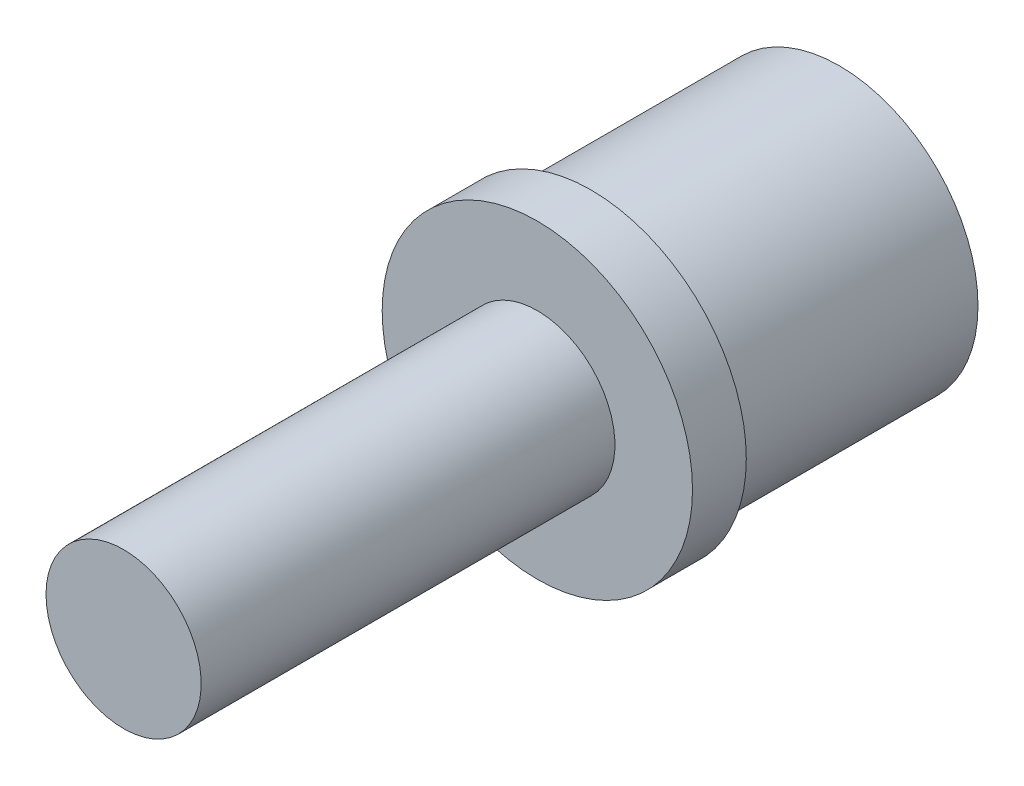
ISO-10303-21;
HEADER;
FILE_DESCRIPTION(('STEP AP214'),'2;1');
FILE_NAME('part.step','',(''),(''),'','','');
FILE_SCHEMA(('AUTOMOTIVE_DESIGN { 1 0 10303 214 1 1 1 1 }'));
ENDSEC;
DATA;
#1=APPLICATION_CONTEXT('core data for automotive mechanical design processes');
#2=APPLICATION_PROTOCOL_DEFINITION('international standard','automotive_design',2000,#1);
#3=PRODUCT_CONTEXT('',#1,'mechanical');
#4=PRODUCT('Part','Part','',(#3));
#5=PRODUCT_RELATED_PRODUCT_CATEGORY('part','',(#4));
#6=PRODUCT_DEFINITION_FORMATION('','',#4);
#7=PRODUCT_DEFINITION_CONTEXT('part definition',#1,'design');
#8=PRODUCT_DEFINITION('design','',#6,#7);
#9=PRODUCT_DEFINITION_SHAPE('','',#8);
#10=(LENGTH_UNIT() NAMED_UNIT(*) SI_UNIT(.MILLI.,.METRE.));
#11=(NAMED_UNIT(*) PLANE_ANGLE_UNIT() SI_UNIT($,.RADIAN.));
#12=(NAMED_UNIT(*) SI_UNIT($,.STERADIAN.) SOLID_ANGLE_UNIT());
#13=UNCERTAINTY_MEASURE_WITH_UNIT(LENGTH_MEASURE(1.E-05),#10,'distance_accuracy_value','');
#14=(GEOMETRIC_REPRESENTATION_CONTEXT(3) GLOBAL_UNCERTAINTY_ASSIGNED_CONTEXT((#13)) GLOBAL_UNIT_ASSIGNED_CONTEXT((#10,
#11,#12)) REPRESENTATION_CONTEXT('',''));
#15=CARTESIAN_POINT('',(0.,0.,0.));
#16=DIRECTION('',(0.,0.,1.));
#17=DIRECTION('',(1.,0.,0.));
#18=AXIS2_PLACEMENT_3D('',#15,#16,#17);
#19=CARTESIAN_POINT('',(0.,0.,43.942));
#20=DIRECTION('',(0.,0.,1.));
#21=DIRECTION('',(1.,0.,0.));
#22=AXIS2_PLACEMENT_3D('',#19,#20,#21);
#23=PLANE('',#22);
#24=CARTESIAN_POINT('',(0.,0.,43.942));
#25=DIRECTION('',(0.,0.,-1.));
#26=DIRECTION('',(-1.,0.,0.));
#27=AXIS2_PLACEMENT_3D('',#24,#25,#26);
#28=CIRCLE('',#27,4.7625);
#29=CARTESIAN_POINT('',(-4.7625,0.,43.942));
#30=VERTEX_POINT('',#29);
#31=EDGE_CURVE('E15',#30,#30,#28,.T.);
#32=ORIENTED_EDGE('',*,*,#31,.F.);
#33=EDGE_LOOP('',(#32));
#34=FACE_BOUND('',#33,.T.);
#35=ADVANCED_FACE('F12',(#34),#23,.T.);
#36=CARTESIAN_POINT('',(0.,0.,43.942));
#37=DIRECTION('',(0.,0.,-1.));
#38=DIRECTION('',(-1.,0.,0.));
#39=AXIS2_PLACEMENT_3D('',#36,#37,#38);
#40=CYLINDRICAL_SURFACE('',#39,4.7625);
#41=CARTESIAN_POINT('',(0.,0.,18.542));
#42=DIRECTION('',(0.,0.,-1.));
#43=DIRECTION('',(-1.,0.,0.));
#44=AXIS2_PLACEMENT_3D('',#41,#42,#43);
#45=CIRCLE('',#44,4.7625);
#46=CARTESIAN_POINT('',(-4.7625,0.,18.542));
#47=VERTEX_POINT('',#46);
#48=EDGE_CURVE('E31',#47,#47,#45,.T.);
#49=ORIENTED_EDGE('',*,*,#48,.F.);
#50=EDGE_LOOP('',(#49));
#51=FACE_BOUND('',#50,.T.);
#52=ORIENTED_EDGE('',*,*,#31,.T.);
#53=EDGE_LOOP('',(#52));
#54=FACE_BOUND('',#53,.T.);
#55=ADVANCED_FACE('F38',(#51,#54),#40,.T.);
#56=CARTESIAN_POINT('',(0.,0.,18.542));
#57=DIRECTION('',(0.,0.,1.));
#58=DIRECTION('',(1.,0.,0.));
#59=AXIS2_PLACEMENT_3D('',#56,#57,#58);
#60=PLANE('',#59);
#61=ORIENTED_EDGE('',*,*,#48,.T.);
#62=EDGE_LOOP('',(#61));
#63=FACE_BOUND('',#62,.T.);
#64=CARTESIAN_POINT('',(0.,0.,18.542));
#65=DIRECTION('',(0.,0.,-1.));
#66=DIRECTION('',(-1.,0.,0.));
#67=AXIS2_PLACEMENT_3D('',#64,#65,#66);
#68=CIRCLE('',#67,9.525);
#69=CARTESIAN_POINT('',(-9.525,0.,18.542));
#70=VERTEX_POINT('',#69);
#71=EDGE_CURVE('E29',#70,#70,#68,.T.);
#72=ORIENTED_EDGE('',*,*,#71,.F.);
#73=EDGE_LOOP('',(#72));
#74=FACE_BOUND('',#73,.T.);
#75=ADVANCED_FACE('F45',(#63,#74),#60,.T.);
#76=CARTESIAN_POINT('',(0.,0.,18.542));
#77=DIRECTION('',(0.,0.,-1.));
#78=DIRECTION('',(-1.,0.,0.));
#79=AXIS2_PLACEMENT_3D('',#76,#77,#78);
#80=CYLINDRICAL_SURFACE('',#79,9.525);
#81=ORIENTED_EDGE('',*,*,#71,.T.);
#82=EDGE_LOOP('',(#81));
#83=FACE_BOUND('',#82,.T.);
#84=CARTESIAN_POINT('',(0.,0.,15.24));
#85=DIRECTION('',(0.,0.,-1.));
#86=DIRECTION('',(-1.,0.,0.));
#87=AXIS2_PLACEMENT_3D('',#84,#85,#86);
#88=CIRCLE('',#87,9.525);
#89=CARTESIAN_POINT('',(-9.525,0.,15.24));
#90=VERTEX_POINT('',#89);
#91=EDGE_CURVE('E24',#90,#90,#88,.F.);
#92=ORIENTED_EDGE('',*,*,#91,.T.);
#93=EDGE_LOOP('',(#92));
#94=FACE_BOUND('',#93,.T.);
#95=ADVANCED_FACE('F61',(#83,#94),#80,.T.);
#96=CARTESIAN_POINT('',(0.,0.,15.24));
#97=DIRECTION('',(0.,0.,1.));
#98=DIRECTION('',(1.,0.,0.));
#99=AXIS2_PLACEMENT_3D('',#96,#97,#98);
#100=PLANE('',#99);
#101=CARTESIAN_POINT('',(0.,0.,15.24));
#102=DIRECTION('',(0.,0.,-1.));
#103=DIRECTION('',(-1.,0.,0.));
#104=AXIS2_PLACEMENT_3D('',#101,#102,#103);
#105=CIRCLE('',#104,8.509);
#106=CARTESIAN_POINT('',(-8.509,0.,15.24));
#107=VERTEX_POINT('',#106);
#108=EDGE_CURVE('E19',#107,#107,#105,.T.);
#109=ORIENTED_EDGE('',*,*,#108,.F.);
#110=EDGE_LOOP('',(#109));
#111=FACE_BOUND('',#110,.T.);
#112=ORIENTED_EDGE('',*,*,#91,.F.);
#113=EDGE_LOOP('',(#112));
#114=FACE_BOUND('',#113,.T.);
#115=ADVANCED_FACE('F54',(#111,#114),#100,.F.);
#116=CARTESIAN_POINT('',(0.,0.,0.));
#117=DIRECTION('',(0.,0.,1.));
#118=DIRECTION('',(1.,0.,0.));
#119=AXIS2_PLACEMENT_3D('',#116,#117,#118);
#120=PLANE('',#119);
#121=CARTESIAN_POINT('',(0.,0.,0.));
#122=DIRECTION('',(0.,0.,-1.));
#123=DIRECTION('',(-1.,0.,0.));
#124=AXIS2_PLACEMENT_3D('',#121,#122,#123);
#125=CIRCLE('',#124,8.509);
#126=CARTESIAN_POINT('',(-8.509,0.,0.));
#127=VERTEX_POINT('',#126);
#128=EDGE_CURVE('E8',#127,#127,#125,.F.);
#129=ORIENTED_EDGE('',*,*,#128,.F.);
#130=EDGE_LOOP('',(#129));
#131=FACE_BOUND('',#130,.T.);
#132=ADVANCED_FACE('F49',(#131),#120,.F.);
#133=CARTESIAN_POINT('',(0.,0.,15.24));
#134=DIRECTION('',(0.,0.,-1.));
#135=DIRECTION('',(-1.,0.,0.));
#136=AXIS2_PLACEMENT_3D('',#133,#134,#135);
#137=CYLINDRICAL_SURFACE('',#136,8.509);
#138=ORIENTED_EDGE('',*,*,#128,.T.);
#139=EDGE_LOOP('',(#138));
#140=FACE_BOUND('',#139,.T.);
#141=ORIENTED_EDGE('',*,*,#108,.T.);
#142=EDGE_LOOP('',(#141));
#143=FACE_BOUND('',#142,.T.);
#144=ADVANCED_FACE('F47',(#140,#143),#137,.T.);
#145=CLOSED_SHELL('',(#35,#55,#75,#95,#115,#132,#144));
#146=MANIFOLD_SOLID_BREP('B1',#145);
#147=ADVANCED_BREP_SHAPE_REPRESENTATION('',(#18,#146),#14);
#148=SHAPE_DEFINITION_REPRESENTATION(#9,#147);
ENDSEC;
END-ISO-10303-21;
